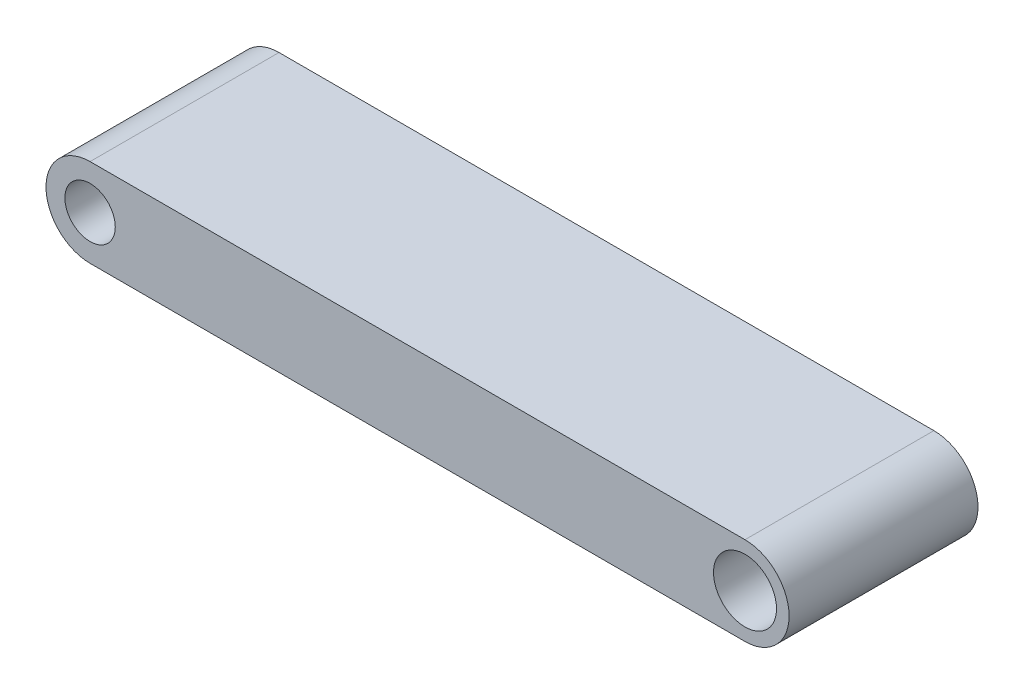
from build123d import *

# Parameters (mm, degrees)
EXTRUDE_1_DEPTH     = 7.5
SKETCH_2_R          = 2.5
CUT_EXTRUDE_1_DEPTH = 15
SKETCH_3_R          = 2
CUT_EXTRUDE_2_DEPTH = 34.279122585


with BuildPart() as part:
    # Sketch 1 → Extrude 1 (new, symmetric)
    with BuildSketch(Plane.XY):
        with BuildLine():
            Line((26, -3.5), (-26, -3.5))
            ThreePointArc((-26, -3.5), (-29.5, 0), (-26, 3.5))
            Line((-26, 3.5), (26, 3.5))
            ThreePointArc((26, 3.5), (29.5, 0), (26, -3.5))
        make_face()
    extrude(amount=EXTRUDE_1_DEPTH, both=True)

    # Sketch 2 → Cut-Extrude 1 (cut)
    with BuildSketch(Plane.XY.offset(7.5)):
        with Locations((26, 0)):
            Circle(SKETCH_2_R)
    extrude(amount=-CUT_EXTRUDE_1_DEPTH, mode=Mode.SUBTRACT)

    # Sketch 3 → Cut-Extrude 2 (cut, through all)
    with BuildSketch(Plane.XY.offset(7.5)):
        with Locations((-26, 0)):
            Circle(SKETCH_3_R)
    extrude(amount=-CUT_EXTRUDE_2_DEPTH, mode=Mode.SUBTRACT)


solid = part.part
